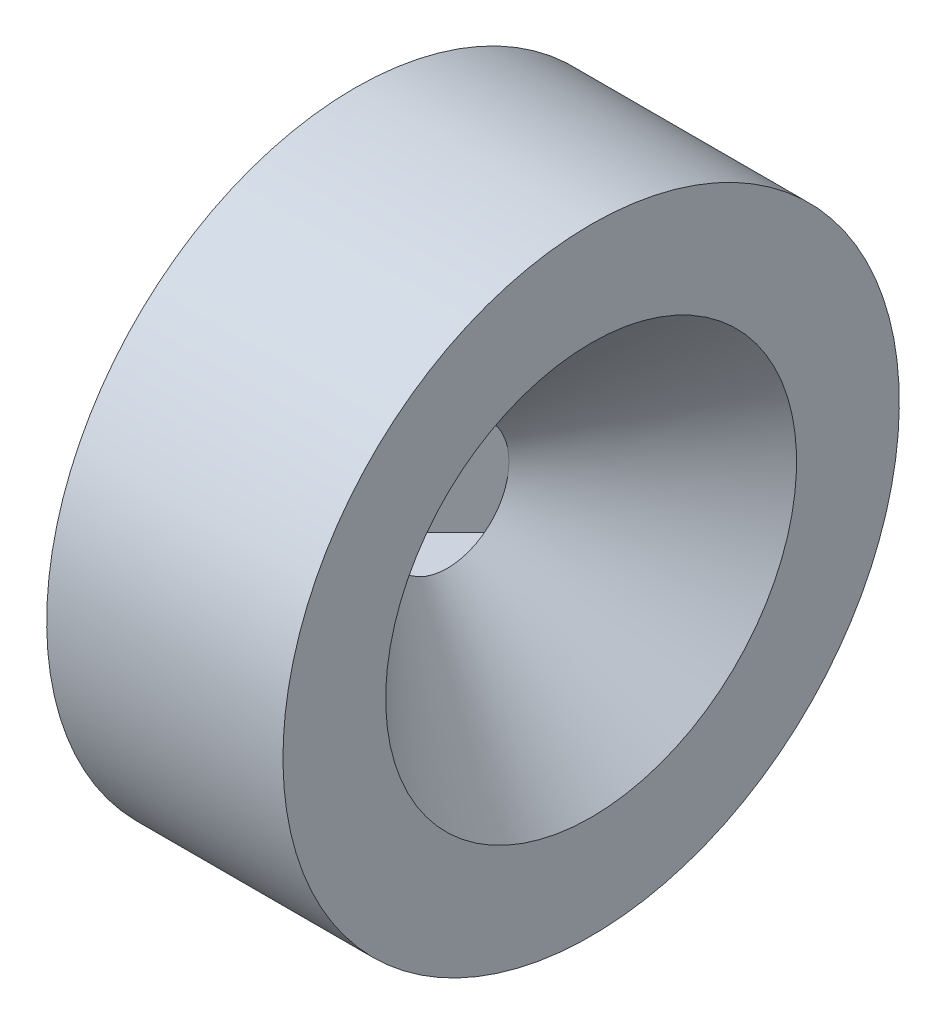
from build123d import *

# Parameters (mm, degrees)
SKETCH1_W                      = 11.5
SKETCH1_H                      = 15
SKETCH2_R                      = 6
BOSS_EXTRUDE1_DEPTH            = 5
CUT_EXTRUDE1_DEPTH             = 6
F_10_0_10_DIAMETER_HOLE1_D     = 10
F_10_0_10_DIAMETER_HOLE1_DEPTH = 5
FILLET1_R                      = 0.2


with BuildPart() as part:
    # Sketch1 → Revolve1 (revolve)
    with BuildSketch(Plane.XY):
        with Locations((5.75, 7.5)):
            Rectangle(SKETCH1_W, SKETCH1_H)
    revolve(axis=Axis((0, 0, 0), (1, 0, 0)))

    # Sketch2 → Boss-Extrude1 (add)
    with BuildSketch(Plane.ZY):
        with Locations(Location((0, 0, 0), (0, 0, 90))):
            Circle(SKETCH2_R)
    extrude(amount=BOSS_EXTRUDE1_DEPTH)

    # Sketch3 → Cut-Extrude1 (cut)
    with BuildSketch(Plane(origin=(0, 3, 0), x_dir=(1, 0, 0), z_dir=(0, 1, 0))):
        Polygon((4.5, 3), (1.5, 0), (4.5, -3), align=None)
    extrude(amount=-CUT_EXTRUDE1_DEPTH, mode=Mode.SUBTRACT)

    # Sketch4 → Cut-Revolve1 (revolve, cut)
    with BuildSketch(Plane(origin=(0, 0, 0), x_dir=(-1, 0, 0), z_dir=(0, 0, -1)), mode=Mode.PRIVATE) as cut_revolve1_sk:
        Polygon((-11.5, 10), (-11.5, 0), (-4.5, 0), (-4.5, 3), align=None)
    revolve(cut_revolve1_sk.sketch.rotate(Axis((11.5, 0, 0), (-1, 0, 0)), 180), axis=Axis((11.5, 0, 0), (-1, 0, 0)), mode=Mode.SUBTRACT)

    # 10.0 _10_ Diameter Hole1
    with Locations(Plane.ZY.offset(5)):
        with Locations((0, 0)):
            Hole(F_10_0_10_DIAMETER_HOLE1_D / 2, depth=F_10_0_10_DIAMETER_HOLE1_DEPTH)

    # Fillet1
    fillet1_edges = [part.edges().sort_by_distance(p)[0] for p in [
        (1.5, 0, 0),
    ]]
    fillet(fillet1_edges, radius=FILLET1_R)


solid = part.part
